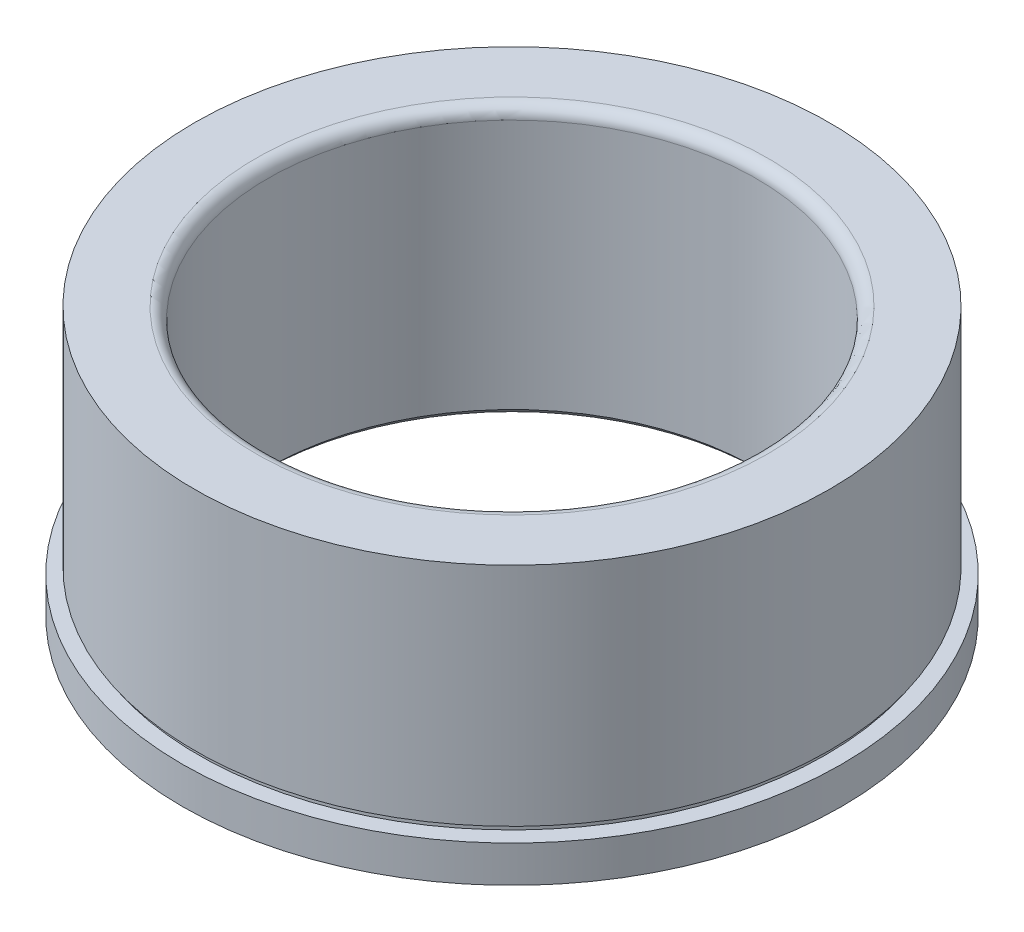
ISO-10303-21;
HEADER;
FILE_DESCRIPTION(('STEP AP214'),'2;1');
FILE_NAME('part.step','',(''),(''),'','','');
FILE_SCHEMA(('AUTOMOTIVE_DESIGN { 1 0 10303 214 1 1 1 1 }'));
ENDSEC;
DATA;
#1=APPLICATION_CONTEXT('core data for automotive mechanical design processes');
#2=APPLICATION_PROTOCOL_DEFINITION('international standard','automotive_design',2000,#1);
#3=PRODUCT_CONTEXT('',#1,'mechanical');
#4=PRODUCT('Part','Part','',(#3));
#5=PRODUCT_RELATED_PRODUCT_CATEGORY('part','',(#4));
#6=PRODUCT_DEFINITION_FORMATION('','',#4);
#7=PRODUCT_DEFINITION_CONTEXT('part definition',#1,'design');
#8=PRODUCT_DEFINITION('design','',#6,#7);
#9=PRODUCT_DEFINITION_SHAPE('','',#8);
#10=(LENGTH_UNIT() NAMED_UNIT(*) SI_UNIT(.MILLI.,.METRE.));
#11=(NAMED_UNIT(*) PLANE_ANGLE_UNIT() SI_UNIT($,.RADIAN.));
#12=(NAMED_UNIT(*) SI_UNIT($,.STERADIAN.) SOLID_ANGLE_UNIT());
#13=UNCERTAINTY_MEASURE_WITH_UNIT(LENGTH_MEASURE(1.E-05),#10,'distance_accuracy_value','');
#14=(GEOMETRIC_REPRESENTATION_CONTEXT(3) GLOBAL_UNCERTAINTY_ASSIGNED_CONTEXT((#13)) GLOBAL_UNIT_ASSIGNED_CONTEXT((#10,
#11,#12)) REPRESENTATION_CONTEXT('',''));
#15=CARTESIAN_POINT('',(0.,0.,0.));
#16=DIRECTION('',(0.,0.,1.));
#17=DIRECTION('',(1.,0.,0.));
#18=AXIS2_PLACEMENT_3D('',#15,#16,#17);
#19=CARTESIAN_POINT('',(-41.28135,50.8506908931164,0.));
#20=DIRECTION('',(0.,-1.,0.));
#21=DIRECTION('',(1.,0.,0.));
#22=AXIS2_PLACEMENT_3D('',#19,#20,#21);
#23=PLANE('',#22);
#24=CARTESIAN_POINT('',(-1.77544341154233E-13,50.8506908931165,0.));
#25=DIRECTION('',(0.,-1.,0.));
#26=DIRECTION('',(1.,0.,0.));
#27=AXIS2_PLACEMENT_3D('',#24,#25,#26);
#28=CIRCLE('',#27,33.2803499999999);
#29=CARTESIAN_POINT('',(33.2803499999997,50.8506908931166,0.));
#30=VERTEX_POINT('',#29);
#31=EDGE_CURVE('E35',#30,#30,#28,.T.);
#32=ORIENTED_EDGE('',*,*,#31,.T.);
#33=EDGE_LOOP('',(#32));
#34=FACE_BOUND('',#33,.T.);
#35=CARTESIAN_POINT('',(-1.77544341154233E-13,50.8506908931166,0.));
#36=DIRECTION('',(0.,-1.,0.));
#37=DIRECTION('',(1.,0.,0.));
#38=AXIS2_PLACEMENT_3D('',#35,#36,#37);
#39=CIRCLE('',#38,41.2813499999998);
#40=CARTESIAN_POINT('',(41.2813499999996,50.8506908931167,0.));
#41=VERTEX_POINT('',#40);
#42=EDGE_CURVE('E63',#41,#41,#39,.T.);
#43=ORIENTED_EDGE('',*,*,#42,.F.);
#44=EDGE_LOOP('',(#43));
#45=FACE_BOUND('',#44,.T.);
#46=ADVANCED_FACE('F28',(#34,#45),#23,.F.);
#47=CARTESIAN_POINT('',(3.49148336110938E-12,-1000.,0.));
#48=DIRECTION('',(0.,-1.,0.));
#49=DIRECTION('',(1.,0.,0.));
#50=AXIS2_PLACEMENT_3D('',#47,#48,#49);
#51=CYLINDRICAL_SURFACE('',#50,31.7563499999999);
#52=CARTESIAN_POINT('',(-1.72223320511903E-13,49.3266908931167,0.));
#53=DIRECTION('',(0.,-1.,0.));
#54=DIRECTION('',(1.,0.,0.));
#55=AXIS2_PLACEMENT_3D('',#52,#53,#54);
#56=CIRCLE('',#55,31.7563499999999);
#57=CARTESIAN_POINT('',(31.7563499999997,49.3266908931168,0.));
#58=VERTEX_POINT('',#57);
#59=EDGE_CURVE('E10',#58,#58,#56,.F.);
#60=ORIENTED_EDGE('',*,*,#59,.T.);
#61=EDGE_LOOP('',(#60));
#62=FACE_BOUND('',#61,.T.);
#63=CARTESIAN_POINT('',(0.,16.7417464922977,0.));
#64=DIRECTION('',(0.,-1.,0.));
#65=DIRECTION('',(1.,0.,0.));
#66=AXIS2_PLACEMENT_3D('',#63,#64,#65);
#67=CIRCLE('',#66,31.7563499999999);
#68=CARTESIAN_POINT('',(31.7563499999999,16.7417464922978,0.));
#69=VERTEX_POINT('',#68);
#70=EDGE_CURVE('E39',#69,#69,#67,.T.);
#71=ORIENTED_EDGE('',*,*,#70,.T.);
#72=EDGE_LOOP('',(#71));
#73=FACE_BOUND('',#72,.T.);
#74=ADVANCED_FACE('F70',(#62,#73),#51,.F.);
#75=CARTESIAN_POINT('',(0.,15.9256908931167,0.));
#76=DIRECTION('',(0.,-1.,0.));
#77=DIRECTION('',(1.,0.,0.));
#78=AXIS2_PLACEMENT_3D('',#75,#76,#77);
#79=CONICAL_SURFACE('',#78,32.5724055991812,0.785398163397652);
#80=ORIENTED_EDGE('',*,*,#70,.F.);
#81=EDGE_LOOP('',(#80));
#82=FACE_BOUND('',#81,.T.);
#83=CARTESIAN_POINT('',(0.,15.9256908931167,0.));
#84=DIRECTION('',(0.,-1.,0.));
#85=DIRECTION('',(1.,0.,0.));
#86=AXIS2_PLACEMENT_3D('',#83,#84,#85);
#87=CIRCLE('',#86,32.5724055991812);
#88=CARTESIAN_POINT('',(32.5724055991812,15.9256908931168,0.));
#89=VERTEX_POINT('',#88);
#90=EDGE_CURVE('E43',#89,#89,#87,.T.);
#91=ORIENTED_EDGE('',*,*,#90,.T.);
#92=EDGE_LOOP('',(#91));
#93=FACE_BOUND('',#92,.T.);
#94=ADVANCED_FACE('F74',(#82,#93),#79,.F.);
#95=CARTESIAN_POINT('',(-32.5724055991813,15.9256908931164,0.));
#96=DIRECTION('',(0.,1.,0.));
#97=DIRECTION('',(-1.,0.,0.));
#98=AXIS2_PLACEMENT_3D('',#95,#96,#97);
#99=PLANE('',#98);
#100=ORIENTED_EDGE('',*,*,#90,.F.);
#101=EDGE_LOOP('',(#100));
#102=FACE_BOUND('',#101,.T.);
#103=CARTESIAN_POINT('',(0.,15.9256908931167,0.));
#104=DIRECTION('',(0.,-1.,0.));
#105=DIRECTION('',(1.,0.,0.));
#106=AXIS2_PLACEMENT_3D('',#103,#104,#105);
#107=CIRCLE('',#106,42.8624999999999);
#108=CARTESIAN_POINT('',(42.8624999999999,15.9256908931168,0.));
#109=VERTEX_POINT('',#108);
#110=EDGE_CURVE('E48',#109,#109,#107,.T.);
#111=ORIENTED_EDGE('',*,*,#110,.T.);
#112=EDGE_LOOP('',(#111));
#113=FACE_BOUND('',#112,.T.);
#114=ADVANCED_FACE('F79',(#102,#113),#99,.F.);
#115=CARTESIAN_POINT('',(3.49148336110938E-12,-1000.,0.));
#116=DIRECTION('',(0.,-1.,0.));
#117=DIRECTION('',(1.,0.,0.));
#118=AXIS2_PLACEMENT_3D('',#115,#116,#117);
#119=CYLINDRICAL_SURFACE('',#118,42.8624999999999);
#120=ORIENTED_EDGE('',*,*,#110,.F.);
#121=EDGE_LOOP('',(#120));
#122=FACE_BOUND('',#121,.T.);
#123=CARTESIAN_POINT('',(0.,20.6881908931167,0.));
#124=DIRECTION('',(0.,-1.,0.));
#125=DIRECTION('',(1.,0.,0.));
#126=AXIS2_PLACEMENT_3D('',#123,#124,#125);
#127=CIRCLE('',#126,42.8624999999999);
#128=CARTESIAN_POINT('',(42.8624999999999,20.6881908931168,0.));
#129=VERTEX_POINT('',#128);
#130=EDGE_CURVE('E51',#129,#129,#127,.T.);
#131=ORIENTED_EDGE('',*,*,#130,.T.);
#132=EDGE_LOOP('',(#131));
#133=FACE_BOUND('',#132,.T.);
#134=ADVANCED_FACE('F83',(#122,#133),#119,.T.);
#135=CARTESIAN_POINT('',(-42.8625,20.6881908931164,0.));
#136=DIRECTION('',(0.,-1.,0.));
#137=DIRECTION('',(1.,0.,0.));
#138=AXIS2_PLACEMENT_3D('',#135,#136,#137);
#139=PLANE('',#138);
#140=ORIENTED_EDGE('',*,*,#130,.F.);
#141=EDGE_LOOP('',(#140));
#142=FACE_BOUND('',#141,.T.);
#143=CARTESIAN_POINT('',(0.,20.6881908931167,0.));
#144=DIRECTION('',(0.,-1.,0.));
#145=DIRECTION('',(1.,0.,0.));
#146=AXIS2_PLACEMENT_3D('',#143,#144,#145);
#147=CIRCLE('',#146,40.7733499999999);
#148=CARTESIAN_POINT('',(40.7733499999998,20.6881908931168,0.));
#149=VERTEX_POINT('',#148);
#150=EDGE_CURVE('E54',#149,#149,#147,.T.);
#151=ORIENTED_EDGE('',*,*,#150,.T.);
#152=EDGE_LOOP('',(#151));
#153=FACE_BOUND('',#152,.T.);
#154=ADVANCED_FACE('F87',(#142,#153),#139,.F.);
#155=CARTESIAN_POINT('',(3.49148336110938E-12,-1000.,0.));
#156=DIRECTION('',(0.,-1.,0.));
#157=DIRECTION('',(1.,0.,0.));
#158=AXIS2_PLACEMENT_3D('',#155,#156,#157);
#159=CYLINDRICAL_SURFACE('',#158,40.7733499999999);
#160=ORIENTED_EDGE('',*,*,#150,.F.);
#161=EDGE_LOOP('',(#160));
#162=FACE_BOUND('',#161,.T.);
#163=CARTESIAN_POINT('',(0.,21.4501908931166,0.));
#164=DIRECTION('',(0.,-1.,0.));
#165=DIRECTION('',(1.,0.,0.));
#166=AXIS2_PLACEMENT_3D('',#163,#164,#165);
#167=CIRCLE('',#166,40.7733499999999);
#168=CARTESIAN_POINT('',(40.7733499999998,21.4501908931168,0.));
#169=VERTEX_POINT('',#168);
#170=EDGE_CURVE('E57',#169,#169,#167,.T.);
#171=ORIENTED_EDGE('',*,*,#170,.T.);
#172=EDGE_LOOP('',(#171));
#173=FACE_BOUND('',#172,.T.);
#174=ADVANCED_FACE('F91',(#162,#173),#159,.T.);
#175=CARTESIAN_POINT('',(-41.28135,21.4501908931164,0.));
#176=DIRECTION('',(0.,1.,0.));
#177=DIRECTION('',(-1.,0.,0.));
#178=AXIS2_PLACEMENT_3D('',#175,#176,#177);
#179=PLANE('',#178);
#180=ORIENTED_EDGE('',*,*,#170,.F.);
#181=EDGE_LOOP('',(#180));
#182=FACE_BOUND('',#181,.T.);
#183=CARTESIAN_POINT('',(0.,21.4501908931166,0.));
#184=DIRECTION('',(0.,-1.,0.));
#185=DIRECTION('',(1.,0.,0.));
#186=AXIS2_PLACEMENT_3D('',#183,#184,#185);
#187=CIRCLE('',#186,41.2813499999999);
#188=CARTESIAN_POINT('',(41.2813499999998,21.4501908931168,0.));
#189=VERTEX_POINT('',#188);
#190=EDGE_CURVE('E60',#189,#189,#187,.T.);
#191=ORIENTED_EDGE('',*,*,#190,.T.);
#192=EDGE_LOOP('',(#191));
#193=FACE_BOUND('',#192,.T.);
#194=ADVANCED_FACE('F95',(#182,#193),#179,.F.);
#195=CARTESIAN_POINT('',(3.49148336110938E-12,-1000.,0.));
#196=DIRECTION('',(0.,-1.,0.));
#197=DIRECTION('',(1.,0.,0.));
#198=AXIS2_PLACEMENT_3D('',#195,#196,#197);
#199=CYLINDRICAL_SURFACE('',#198,41.2813499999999);
#200=ORIENTED_EDGE('',*,*,#190,.F.);
#201=EDGE_LOOP('',(#200));
#202=FACE_BOUND('',#201,.T.);
#203=ORIENTED_EDGE('',*,*,#42,.T.);
#204=EDGE_LOOP('',(#203));
#205=FACE_BOUND('',#204,.T.);
#206=ADVANCED_FACE('F67',(#202,#205),#199,.T.);
#207=CARTESIAN_POINT('',(-1.72223320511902E-13,49.3266908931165,0.));
#208=DIRECTION('',(0.,-1.,0.));
#209=DIRECTION('',(1.,0.,0.));
#210=AXIS2_PLACEMENT_3D('',#207,#208,#209);
#211=TOROIDAL_SURFACE('',#210,33.2803499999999,1.524);
#212=ORIENTED_EDGE('',*,*,#59,.F.);
#213=EDGE_LOOP('',(#212));
#214=FACE_BOUND('',#213,.T.);
#215=ORIENTED_EDGE('',*,*,#31,.F.);
#216=EDGE_LOOP('',(#215));
#217=FACE_BOUND('',#216,.T.);
#218=ADVANCED_FACE('F30',(#214,#217),#211,.T.);
#219=CLOSED_SHELL('',(#46,#74,#94,#114,#134,#154,#174,#194,#206,#218));
#220=MANIFOLD_SOLID_BREP('B2',#219);
#221=ADVANCED_BREP_SHAPE_REPRESENTATION('',(#18,#220),#14);
#222=SHAPE_DEFINITION_REPRESENTATION(#9,#221);
ENDSEC;
END-ISO-10303-21;
